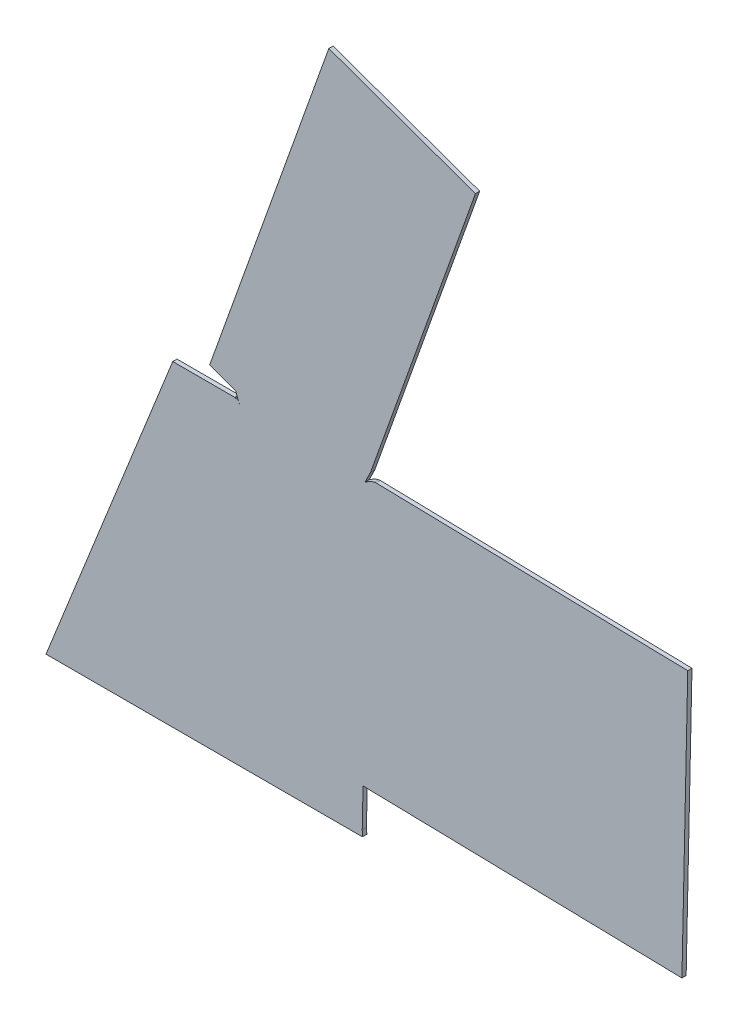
ISO-10303-21;
HEADER;
FILE_DESCRIPTION(('STEP AP214'),'2;1');
FILE_NAME('part.step','',(''),(''),'','','');
FILE_SCHEMA(('AUTOMOTIVE_DESIGN { 1 0 10303 214 1 1 1 1 }'));
ENDSEC;
DATA;
#1=APPLICATION_CONTEXT('core data for automotive mechanical design processes');
#2=APPLICATION_PROTOCOL_DEFINITION('international standard','automotive_design',2000,#1);
#3=PRODUCT_CONTEXT('',#1,'mechanical');
#4=PRODUCT('Part','Part','',(#3));
#5=PRODUCT_RELATED_PRODUCT_CATEGORY('part','',(#4));
#6=PRODUCT_DEFINITION_FORMATION('','',#4);
#7=PRODUCT_DEFINITION_CONTEXT('part definition',#1,'design');
#8=PRODUCT_DEFINITION('design','',#6,#7);
#9=PRODUCT_DEFINITION_SHAPE('','',#8);
#10=(LENGTH_UNIT() NAMED_UNIT(*) SI_UNIT(.MILLI.,.METRE.));
#11=(NAMED_UNIT(*) PLANE_ANGLE_UNIT() SI_UNIT($,.RADIAN.));
#12=(NAMED_UNIT(*) SI_UNIT($,.STERADIAN.) SOLID_ANGLE_UNIT());
#13=UNCERTAINTY_MEASURE_WITH_UNIT(LENGTH_MEASURE(1.E-05),#10,'distance_accuracy_value','');
#14=(GEOMETRIC_REPRESENTATION_CONTEXT(3) GLOBAL_UNCERTAINTY_ASSIGNED_CONTEXT((#13)) GLOBAL_UNIT_ASSIGNED_CONTEXT((#10,
#11,#12)) REPRESENTATION_CONTEXT('',''));
#15=CARTESIAN_POINT('',(0.,0.,0.));
#16=DIRECTION('',(0.,0.,1.));
#17=DIRECTION('',(1.,0.,0.));
#18=AXIS2_PLACEMENT_3D('',#15,#16,#17);
#19=CARTESIAN_POINT('',(73.2991904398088,21.0722076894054,-2.00000000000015));
#20=DIRECTION('',(0.0216745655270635,0.999765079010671,0.));
#21=DIRECTION('',(-0.315772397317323,0.00684583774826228,0.948810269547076));
#22=AXIS2_PLACEMENT_3D('',#19,#20,#21);
#23=PLANE('',#22);
#24=DIRECTION('',(0.,0.,1.));
#25=VECTOR('',#24,1.);
#26=CARTESIAN_POINT('',(75.1014282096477,21.0331357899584,-2.0000000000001));
#27=LINE('',#26,#25);
#28=CARTESIAN_POINT('',(75.1014282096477,21.0331357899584,-2.0000000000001));
#29=VERTEX_POINT('',#28);
#30=CARTESIAN_POINT('',(75.1014282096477,21.0331357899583,0.));
#31=VERTEX_POINT('',#30);
#32=EDGE_CURVE('E403',#29,#31,#27,.T.);
#33=ORIENTED_EDGE('',*,*,#32,.F.);
#34=DIRECTION('',(-0.999765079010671,0.0216745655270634,0.));
#35=VECTOR('',#34,1.);
#36=CARTESIAN_POINT('',(75.1014282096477,21.0331357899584,-2.0000000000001));
#37=LINE('',#36,#35);
#38=CARTESIAN_POINT('',(73.2991904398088,21.0722076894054,-2.0000000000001));
#39=VERTEX_POINT('',#38);
#40=EDGE_CURVE('E459',#29,#39,#37,.T.);
#41=ORIENTED_EDGE('',*,*,#40,.T.);
#42=DIRECTION('',(0.,0.,1.));
#43=VECTOR('',#42,1.);
#44=CARTESIAN_POINT('',(73.2991904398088,21.0722076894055,-2.0000000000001));
#45=LINE('',#44,#43);
#46=CARTESIAN_POINT('',(73.2991904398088,21.0722076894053,0.));
#47=VERTEX_POINT('',#46);
#48=EDGE_CURVE('E462',#39,#47,#45,.T.);
#49=ORIENTED_EDGE('',*,*,#48,.T.);
#50=DIRECTION('',(0.999765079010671,-0.0216745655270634,0.));
#51=VECTOR('',#50,1.);
#52=CARTESIAN_POINT('',(75.7670457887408,21.0187054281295,-1.04517089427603E-13));
#53=LINE('',#52,#51);
#54=EDGE_CURVE('E450',#47,#31,#53,.T.);
#55=ORIENTED_EDGE('',*,*,#54,.T.);
#56=EDGE_LOOP('',(#33,#41,#49,#55));
#57=FACE_BOUND('',#56,.T.);
#58=ADVANCED_FACE('F123',(#57),#23,.T.);
#59=CARTESIAN_POINT('',(75.3140911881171,0.125636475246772,-1.42247325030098E-13));
#60=DIRECTION('',(0.,0.,-1.));
#61=DIRECTION('',(-0.999785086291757,-0.0207311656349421,0.));
#62=AXIS2_PLACEMENT_3D('',#59,#60,#61);
#63=PLANE('',#62);
#64=ORIENTED_EDGE('',*,*,#54,.F.);
#65=DIRECTION('',(-0.99976507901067,0.0216745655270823,0.));
#66=VECTOR('',#65,1.);
#67=CARTESIAN_POINT('',(77.6712294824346,20.9774233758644,0.));
#68=LINE('',#67,#66);
#69=CARTESIAN_POINT('',(226.070760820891,17.7601722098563,1.74122868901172E-12));
#70=VERTEX_POINT('',#69);
#71=EDGE_CURVE('E405',#70,#47,#68,.T.);
#72=ORIENTED_EDGE('',*,*,#71,.F.);
#73=DIRECTION('',(0.0216745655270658,0.999765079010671,0.));
#74=VECTOR('',#73,1.);
#75=CARTESIAN_POINT('',(228.780081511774,142.73080708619,2.1163626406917E-12));
#76=LINE('',#75,#74);
#77=CARTESIAN_POINT('',(228.832735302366,145.159525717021,2.1163626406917E-12));
#78=VERTEX_POINT('',#77);
#79=EDGE_CURVE('E467',#70,#78,#76,.T.);
#80=ORIENTED_EDGE('',*,*,#79,.T.);
#81=DIRECTION('',(0.999765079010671,-0.0216745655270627,0.));
#82=VECTOR('',#81,1.);
#83=CARTESIAN_POINT('',(80.4332039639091,148.376776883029,3.15285991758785E-13));
#84=LINE('',#83,#82);
#85=CARTESIAN_POINT('',(81.2652259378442,148.358738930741,3.33066907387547E-13));
#86=VERTEX_POINT('',#85);
#87=EDGE_CURVE('E391',#86,#78,#84,.T.);
#88=ORIENTED_EDGE('',*,*,#87,.F.);
#89=CARTESIAN_POINT('',(80.4303448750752,148.244898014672,2.97938756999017E-13));
#90=CARTESIAN_POINT('',(80.4998448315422,148.263627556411,3.19189119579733E-13));
#91=CARTESIAN_POINT('',(80.6376474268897,148.300763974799,3.2612801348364E-13));
#92=CARTESIAN_POINT('',(80.8473160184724,148.336766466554,2.22044604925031E-13));
#93=CARTESIAN_POINT('',(81.0564439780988,148.358463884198,3.19189119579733E-13));
#94=CARTESIAN_POINT('',(81.1957784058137,148.358647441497,3.49980461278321E-13));
#95=CARTESIAN_POINT('',(81.2652259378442,148.358738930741,3.40005801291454E-13));
#96=B_SPLINE_CURVE_WITH_KNOTS('',3,(#89,#90,#91,#92,#93,#94,#95),.UNSPECIFIED.,.F.,.F.,(4,1,1,1,
4),(0.,0.255209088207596,0.506021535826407,0.753789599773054,1.),.UNSPECIFIED.);
#97=CARTESIAN_POINT('',(80.4303448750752,148.244898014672,2.97938756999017E-13));
#98=VERTEX_POINT('',#97);
#99=EDGE_CURVE('E370',#98,#86,#96,.T.);
#100=ORIENTED_EDGE('',*,*,#99,.F.);
#101=CARTESIAN_POINT('',(76.008511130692,146.042842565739,2.48327853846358E-13));
#102=CARTESIAN_POINT('',(77.4232207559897,147.002562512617,2.58530585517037E-13));
#103=CARTESIAN_POINT('',(78.1086837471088,147.373267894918,2.63228133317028E-13));
#104=CARTESIAN_POINT('',(79.1523921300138,147.937716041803,2.70380773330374E-13));
#105=CARTESIAN_POINT('',(80.4303448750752,148.244898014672,2.78137405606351E-13));
#106=B_SPLINE_CURVE_WITH_KNOTS('',2,(#101,#102,#103,#104,#105),.UNSPECIFIED.,.F.,.F.,(3,2,3),
(0.,0.5,1.),.UNSPECIFIED.);
#107=CARTESIAN_POINT('',(76.008511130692,146.042842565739,2.53269627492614E-13));
#108=VERTEX_POINT('',#107);
#109=EDGE_CURVE('E407',#108,#98,#106,.T.);
#110=ORIENTED_EDGE('',*,*,#109,.F.);
#111=DIRECTION('',(-0.441719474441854,-0.89715322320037,0.));
#112=VECTOR('',#111,1.);
#113=CARTESIAN_POINT('',(78.6874249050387,151.483843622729,3.05311331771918E-13));
#114=LINE('',#113,#112);
#115=CARTESIAN_POINT('',(78.6874249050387,151.483843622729,4.37150315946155E-13));
#116=VERTEX_POINT('',#115);
#117=EDGE_CURVE('E474',#116,#108,#114,.T.);
#118=ORIENTED_EDGE('',*,*,#117,.F.);
#119=DIRECTION('',(0.336313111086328,0.941750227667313,0.));
#120=VECTOR('',#119,1.);
#121=CARTESIAN_POINT('',(17.0300081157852,-21.1704014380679,-2.12330153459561E-12));
#122=LINE('',#121,#120);
#123=CARTESIAN_POINT('',(128.335891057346,290.510401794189,2.26901830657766E-12));
#124=VERTEX_POINT('',#123);
#125=EDGE_CURVE('E332',#116,#124,#122,.T.);
#126=ORIENTED_EDGE('',*,*,#125,.T.);
#127=DIRECTION('',(-0.941741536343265,0.336337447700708,0.));
#128=VECTOR('',#127,1.);
#129=CARTESIAN_POINT('',(73.0232796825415,310.264975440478,1.89431803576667E-12));
#130=LINE('',#129,#128);
#131=CARTESIAN_POINT('',(58.8971566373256,315.310037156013,1.81105130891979E-12));
#132=VERTEX_POINT('',#131);
#133=EDGE_CURVE('E330',#124,#132,#130,.T.);
#134=ORIENTED_EDGE('',*,*,#133,.T.);
#135=DIRECTION('',(-0.336337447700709,-0.941741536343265,0.));
#136=VECTOR('',#135,1.);
#137=CARTESIAN_POINT('',(2.45509657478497,157.272825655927,-2.25514051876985E-13));
#138=LINE('',#137,#136);
#139=CARTESIAN_POINT('',(2.45509657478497,157.272825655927,-2.25514051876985E-13));
#140=VERTEX_POINT('',#139);
#141=EDGE_CURVE('E328',#132,#140,#138,.T.);
#142=ORIENTED_EDGE('',*,*,#141,.T.);
#143=DIRECTION('',(0.941741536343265,-0.336337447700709,0.));
#144=VECTOR('',#143,1.);
#145=CARTESIAN_POINT('',(2.45509657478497,157.272825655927,-2.25514051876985E-13));
#146=LINE('',#145,#144);
#147=CARTESIAN_POINT('',(14.7851396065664,152.869223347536,-1.35308431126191E-13));
#148=VERTEX_POINT('',#147);
#149=EDGE_CURVE('E325',#140,#148,#146,.T.);
#150=ORIENTED_EDGE('',*,*,#149,.T.);
#151=DIRECTION('',(-0.357346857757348,0.933971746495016,0.));
#152=VECTOR('',#151,1.);
#153=CARTESIAN_POINT('',(16.9067401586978,147.324148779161,0.));
#154=LINE('',#153,#152);
#155=CARTESIAN_POINT('',(16.9067401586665,147.324148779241,0.));
#156=VERTEX_POINT('',#155);
#157=EDGE_CURVE('E327',#156,#148,#154,.T.);
#158=ORIENTED_EDGE('',*,*,#157,.F.);
#159=DIRECTION('',(0.371390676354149,-0.928476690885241,0.));
#160=VECTOR('',#159,1.);
#161=CARTESIAN_POINT('',(75.7210341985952,0.288413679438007,-1.2490009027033E-13));
#162=LINE('',#161,#160);
#163=CARTESIAN_POINT('',(15.8977554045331,149.846610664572,0.));
#164=VERTEX_POINT('',#163);
#165=EDGE_CURVE('E483',#164,#156,#162,.T.);
#166=ORIENTED_EDGE('',*,*,#165,.F.);
#167=DIRECTION('',(0.995853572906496,0.0909706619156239,0.));
#168=VECTOR('',#167,1.);
#169=CARTESIAN_POINT('',(14.635427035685,149.731297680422,0.));
#170=LINE('',#169,#168);
#171=CARTESIAN_POINT('',(14.635427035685,149.731297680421,0.));
#172=VERTEX_POINT('',#171);
#173=EDGE_CURVE('E316',#172,#164,#170,.T.);
#174=ORIENTED_EDGE('',*,*,#173,.F.);
#175=DIRECTION('',(1.,0.,0.));
#176=VECTOR('',#175,1.);
#177=CARTESIAN_POINT('',(-75.,149.731297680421,0.));
#178=LINE('',#177,#176);
#179=CARTESIAN_POINT('',(14.4086810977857,149.731297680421,0.));
#180=VERTEX_POINT('',#179);
#181=EDGE_CURVE('E287',#180,#172,#178,.T.);
#182=ORIENTED_EDGE('',*,*,#181,.F.);
#183=DIRECTION('',(-0.044282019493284,-0.999019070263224,0.));
#184=VECTOR('',#183,1.);
#185=CARTESIAN_POINT('',(7.60945957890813,-3.66170557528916,0.));
#186=LINE('',#185,#184);
#187=CARTESIAN_POINT('',(14.42059146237,150.,0.));
#188=VERTEX_POINT('',#187);
#189=EDGE_CURVE('E286',#188,#180,#186,.T.);
#190=ORIENTED_EDGE('',*,*,#189,.F.);
#191=DIRECTION('',(-1.,0.,0.));
#192=VECTOR('',#191,1.);
#193=CARTESIAN_POINT('',(15.,150.,0.));
#194=LINE('',#193,#192);
#195=CARTESIAN_POINT('',(-15.,150.,0.));
#196=VERTEX_POINT('',#195);
#197=EDGE_CURVE('E533',#188,#196,#194,.T.);
#198=ORIENTED_EDGE('',*,*,#197,.T.);
#199=DIRECTION('',(-0.371390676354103,-0.92847669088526,0.));
#200=VECTOR('',#199,1.);
#201=CARTESIAN_POINT('',(-15.,150.,0.));
#202=LINE('',#201,#200);
#203=CARTESIAN_POINT('',(-74.9999999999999,-1.94289029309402E-13,0.));
#204=VERTEX_POINT('',#203);
#205=EDGE_CURVE('E534',#196,#204,#202,.T.);
#206=ORIENTED_EDGE('',*,*,#205,.T.);
#207=DIRECTION('',(1.,0.,0.));
#208=VECTOR('',#207,1.);
#209=CARTESIAN_POINT('',(-74.9999999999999,-1.94289029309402E-13,0.));
#210=LINE('',#209,#208);
#211=CARTESIAN_POINT('',(74.5279461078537,0.,-1.38777878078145E-13));
#212=VERTEX_POINT('',#211);
#213=EDGE_CURVE('E288',#204,#212,#210,.T.);
#214=ORIENTED_EDGE('',*,*,#213,.T.);
#215=DIRECTION('',(-0.972003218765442,-0.234967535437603,0.));
#216=VECTOR('',#215,1.);
#217=CARTESIAN_POINT('',(74.9003030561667,0.0900118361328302,0.));
#218=LINE('',#217,#216);
#219=CARTESIAN_POINT('',(74.9003030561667,0.0900118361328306,0.));
#220=VERTEX_POINT('',#219);
#221=EDGE_CURVE('E315',#220,#212,#218,.T.);
#222=ORIENTED_EDGE('',*,*,#221,.F.);
#223=CARTESIAN_POINT('',(74.7066675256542,2.82433036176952,-1.38542843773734E-13));
#224=CARTESIAN_POINT('',(74.7725291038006,1.75034186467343,-1.40984080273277E-13));
#225=CARTESIAN_POINT('',(74.9003030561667,0.0900118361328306,-1.44615396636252E-13));
#226=B_SPLINE_CURVE_WITH_KNOTS('',2,(#223,#224,#225),.UNSPECIFIED.,.F.,.F.,(3,3),(0.,1.),.UNSPECIFIED.);
#227=CARTESIAN_POINT('',(74.7066675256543,2.82433036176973,-1.38777878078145E-13));
#228=VERTEX_POINT('',#227);
#229=EDGE_CURVE('E319',#228,#220,#226,.T.);
#230=ORIENTED_EDGE('',*,*,#229,.F.);
#231=DIRECTION('',(0.0216745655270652,0.999765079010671,0.));
#232=VECTOR('',#231,1.);
#233=CARTESIAN_POINT('',(74.648473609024,0.140066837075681,-1.49186218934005E-13));
#234=LINE('',#233,#232);
#235=EDGE_CURVE('E453',#228,#31,#234,.T.);
#236=ORIENTED_EDGE('',*,*,#235,.T.);
#237=EDGE_LOOP('',(#64,#72,#80,#88,#100,#110,#118,#126,#134,#142,#150,#158,#166,#174,#182,#190,
#198,#206,#214,#222,#230,#236));
#238=FACE_BOUND('',#237,.T.);
#239=ADVANCED_FACE('F495',(#238),#63,.F.);
#240=CARTESIAN_POINT('',(-74.9999999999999,-1.94289029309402E-13,-1.99999999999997));
#241=DIRECTION('',(0.,0.,1.));
#242=DIRECTION('',(1.,0.,0.));
#243=AXIS2_PLACEMENT_3D('',#240,#241,#242);
#244=PLANE('',#243);
#245=DIRECTION('',(-0.441719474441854,-0.89715322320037,0.));
#246=VECTOR('',#245,1.);
#247=CARTESIAN_POINT('',(78.6874249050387,151.483843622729,-1.9999999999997));
#248=LINE('',#247,#246);
#249=CARTESIAN_POINT('',(78.6874249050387,151.483843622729,-1.99999999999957));
#250=VERTEX_POINT('',#249);
#251=CARTESIAN_POINT('',(76.008511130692,146.042842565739,-1.99999999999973));
#252=VERTEX_POINT('',#251);
#253=EDGE_CURVE('E470',#250,#252,#248,.T.);
#254=ORIENTED_EDGE('',*,*,#253,.T.);
#255=CARTESIAN_POINT('',(76.008511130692,146.042842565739,-1.99999999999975));
#256=CARTESIAN_POINT('',(77.4232207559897,147.002562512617,-1.99999999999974));
#257=CARTESIAN_POINT('',(78.1086837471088,147.373267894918,-1.99999999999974));
#258=CARTESIAN_POINT('',(79.1523921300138,147.937716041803,-1.99999999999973));
#259=CARTESIAN_POINT('',(80.4303448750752,148.244898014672,-1.99999999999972));
#260=B_SPLINE_CURVE_WITH_KNOTS('',2,(#255,#256,#257,#258,#259),.UNSPECIFIED.,.F.,.F.,(3,2,3),
(0.,0.5,1.),.UNSPECIFIED.);
#261=CARTESIAN_POINT('',(80.4303448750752,148.244898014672,-1.99999999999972));
#262=VERTEX_POINT('',#261);
#263=EDGE_CURVE('E404',#252,#262,#260,.T.);
#264=ORIENTED_EDGE('',*,*,#263,.T.);
#265=CARTESIAN_POINT('',(80.4303448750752,148.244898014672,-1.9999999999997));
#266=CARTESIAN_POINT('',(80.4998448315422,148.263627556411,-1.99999999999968));
#267=CARTESIAN_POINT('',(80.6376474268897,148.300763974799,-1.9999999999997));
#268=CARTESIAN_POINT('',(80.8473160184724,148.336766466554,-1.99999999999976));
#269=CARTESIAN_POINT('',(81.0564439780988,148.358463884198,-1.99999999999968));
#270=CARTESIAN_POINT('',(81.1957784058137,148.358647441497,-1.99999999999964));
#271=CARTESIAN_POINT('',(81.2652259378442,148.358738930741,-1.99999999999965));
#272=B_SPLINE_CURVE_WITH_KNOTS('',3,(#265,#266,#267,#268,#269,#270,#271),.UNSPECIFIED.,.F.,.F.,
(4,1,1,1,4),(0.,0.255209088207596,0.506021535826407,0.753789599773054,1.),.UNSPECIFIED.);
#273=CARTESIAN_POINT('',(81.2652259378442,148.358738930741,-1.99999999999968));
#274=VERTEX_POINT('',#273);
#275=EDGE_CURVE('E378',#262,#274,#272,.T.);
#276=ORIENTED_EDGE('',*,*,#275,.T.);
#277=DIRECTION('',(0.999765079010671,-0.0216745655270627,0.));
#278=VECTOR('',#277,1.);
#279=CARTESIAN_POINT('',(80.4332039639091,148.376776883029,-1.9999999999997));
#280=LINE('',#279,#278);
#281=CARTESIAN_POINT('',(228.832735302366,145.159525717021,-1.99999999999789));
#282=VERTEX_POINT('',#281);
#283=EDGE_CURVE('E374',#274,#282,#280,.T.);
#284=ORIENTED_EDGE('',*,*,#283,.T.);
#285=DIRECTION('',(0.0216745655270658,0.999765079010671,0.));
#286=VECTOR('',#285,1.);
#287=CARTESIAN_POINT('',(228.780081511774,142.73080708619,-1.99999999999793));
#288=LINE('',#287,#286);
#289=CARTESIAN_POINT('',(226.070760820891,17.7601722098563,-1.99999999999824));
#290=VERTEX_POINT('',#289);
#291=EDGE_CURVE('E397',#290,#282,#288,.T.);
#292=ORIENTED_EDGE('',*,*,#291,.F.);
#293=DIRECTION('',(-0.99976507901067,0.0216745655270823,0.));
#294=VECTOR('',#293,1.);
#295=CARTESIAN_POINT('',(77.6712294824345,20.9774233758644,-2.00000000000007));
#296=LINE('',#295,#294);
#297=EDGE_CURVE('E400',#290,#39,#296,.T.);
#298=ORIENTED_EDGE('',*,*,#297,.T.);
#299=ORIENTED_EDGE('',*,*,#40,.F.);
#300=DIRECTION('',(0.0216745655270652,0.999765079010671,0.));
#301=VECTOR('',#300,1.);
#302=CARTESIAN_POINT('',(74.648473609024,0.140066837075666,-2.00000000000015));
#303=LINE('',#302,#301);
#304=CARTESIAN_POINT('',(74.7066675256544,2.82433036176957,-2.0000000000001));
#305=VERTEX_POINT('',#304);
#306=EDGE_CURVE('E456',#305,#29,#303,.T.);
#307=ORIENTED_EDGE('',*,*,#306,.F.);
#308=CARTESIAN_POINT('',(74.7066675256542,2.82433036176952,-2.00000000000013));
#309=CARTESIAN_POINT('',(74.7725291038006,1.75034186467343,-2.00000000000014));
#310=CARTESIAN_POINT('',(74.9003030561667,0.0900118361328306,-2.00000000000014));
#311=B_SPLINE_CURVE_WITH_KNOTS('',2,(#308,#309,#310),.UNSPECIFIED.,.F.,.F.,(3,3),(0.,1.),.UNSPECIFIED.);
#312=CARTESIAN_POINT('',(74.9003030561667,0.0900118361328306,-2.00000000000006));
#313=VERTEX_POINT('',#312);
#314=EDGE_CURVE('E314',#305,#313,#311,.T.);
#315=ORIENTED_EDGE('',*,*,#314,.T.);
#316=DIRECTION('',(-0.972003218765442,-0.234967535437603,0.));
#317=VECTOR('',#316,1.);
#318=CARTESIAN_POINT('',(74.9003030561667,0.0900118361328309,-2.00000000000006));
#319=LINE('',#318,#317);
#320=CARTESIAN_POINT('',(74.5279461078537,0.,-2.00000000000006));
#321=VERTEX_POINT('',#320);
#322=EDGE_CURVE('E320',#313,#321,#319,.T.);
#323=ORIENTED_EDGE('',*,*,#322,.T.);
#324=DIRECTION('',(1.,0.,0.));
#325=VECTOR('',#324,1.);
#326=CARTESIAN_POINT('',(-74.9999999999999,-1.94289029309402E-13,-1.99999999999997));
#327=LINE('',#326,#325);
#328=CARTESIAN_POINT('',(-74.9999999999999,-1.94289029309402E-13,-1.99999999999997));
#329=VERTEX_POINT('',#328);
#330=EDGE_CURVE('E294',#329,#321,#327,.T.);
#331=ORIENTED_EDGE('',*,*,#330,.F.);
#332=DIRECTION('',(-0.371390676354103,-0.92847669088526,0.));
#333=VECTOR('',#332,1.);
#334=CARTESIAN_POINT('',(-15.,150.,-1.99999999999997));
#335=LINE('',#334,#333);
#336=CARTESIAN_POINT('',(-15.,150.,-1.99999999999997));
#337=VERTEX_POINT('',#336);
#338=EDGE_CURVE('E301',#337,#329,#335,.T.);
#339=ORIENTED_EDGE('',*,*,#338,.F.);
#340=DIRECTION('',(-1.,0.,0.));
#341=VECTOR('',#340,1.);
#342=CARTESIAN_POINT('',(15.,150.,-2.00000000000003));
#343=LINE('',#342,#341);
#344=CARTESIAN_POINT('',(14.42059146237,150.,-2.));
#345=VERTEX_POINT('',#344);
#346=EDGE_CURVE('E293',#345,#337,#343,.T.);
#347=ORIENTED_EDGE('',*,*,#346,.F.);
#348=DIRECTION('',(-0.044282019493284,-0.999019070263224,0.));
#349=VECTOR('',#348,1.);
#350=CARTESIAN_POINT('',(7.60945957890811,-3.66170557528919,-2.00000000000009));
#351=LINE('',#350,#349);
#352=CARTESIAN_POINT('',(14.4086810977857,149.731297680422,-2.00000000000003));
#353=VERTEX_POINT('',#352);
#354=EDGE_CURVE('E279',#345,#353,#351,.T.);
#355=ORIENTED_EDGE('',*,*,#354,.T.);
#356=DIRECTION('',(1.,0.,0.));
#357=VECTOR('',#356,1.);
#358=CARTESIAN_POINT('',(-75.,149.731297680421,-1.99999999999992));
#359=LINE('',#358,#357);
#360=CARTESIAN_POINT('',(14.635427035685,149.731297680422,-2.00000000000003));
#361=VERTEX_POINT('',#360);
#362=EDGE_CURVE('E268',#353,#361,#359,.T.);
#363=ORIENTED_EDGE('',*,*,#362,.T.);
#364=DIRECTION('',(0.995853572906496,0.0909706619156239,0.));
#365=VECTOR('',#364,1.);
#366=CARTESIAN_POINT('',(14.635427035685,149.731297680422,-1.99999999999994));
#367=LINE('',#366,#365);
#368=CARTESIAN_POINT('',(15.8977554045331,149.846610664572,-2.00000000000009));
#369=VERTEX_POINT('',#368);
#370=EDGE_CURVE('E312',#361,#369,#367,.T.);
#371=ORIENTED_EDGE('',*,*,#370,.T.);
#372=DIRECTION('',(0.371390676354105,-0.928476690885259,0.));
#373=VECTOR('',#372,1.);
#374=CARTESIAN_POINT('',(15.721034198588,150.288413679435,-2.00000000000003));
#375=LINE('',#374,#373);
#376=CARTESIAN_POINT('',(16.9067401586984,147.324148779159,-1.99999999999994));
#377=VERTEX_POINT('',#376);
#378=EDGE_CURVE('E13',#369,#377,#375,.T.);
#379=ORIENTED_EDGE('',*,*,#378,.T.);
#380=DIRECTION('',(-0.357346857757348,0.933971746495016,0.));
#381=VECTOR('',#380,1.);
#382=CARTESIAN_POINT('',(16.9067401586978,147.324148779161,-2.00000000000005));
#383=LINE('',#382,#381);
#384=CARTESIAN_POINT('',(14.7851396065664,152.869223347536,-2.00000000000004));
#385=VERTEX_POINT('',#384);
#386=EDGE_CURVE('E473',#377,#385,#383,.T.);
#387=ORIENTED_EDGE('',*,*,#386,.T.);
#388=DIRECTION('',(0.941741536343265,-0.336337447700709,0.));
#389=VECTOR('',#388,1.);
#390=CARTESIAN_POINT('',(2.45509657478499,157.272825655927,-2.00000000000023));
#391=LINE('',#390,#389);
#392=CARTESIAN_POINT('',(2.45509657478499,157.272825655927,-2.00000000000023));
#393=VERTEX_POINT('',#392);
#394=EDGE_CURVE('E335',#393,#385,#391,.T.);
#395=ORIENTED_EDGE('',*,*,#394,.F.);
#396=DIRECTION('',(-0.336337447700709,-0.941741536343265,0.));
#397=VECTOR('',#396,1.);
#398=CARTESIAN_POINT('',(2.45509657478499,157.272825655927,-2.00000000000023));
#399=LINE('',#398,#397);
#400=CARTESIAN_POINT('',(58.8971566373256,315.310037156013,-1.99999999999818));
#401=VERTEX_POINT('',#400);
#402=EDGE_CURVE('E351',#401,#393,#399,.T.);
#403=ORIENTED_EDGE('',*,*,#402,.F.);
#404=DIRECTION('',(-0.941741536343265,0.33633744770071,0.));
#405=VECTOR('',#404,1.);
#406=CARTESIAN_POINT('',(58.8971566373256,315.310037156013,-1.99999999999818));
#407=LINE('',#406,#405);
#408=CARTESIAN_POINT('',(128.335891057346,290.510401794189,-1.99999999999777));
#409=VERTEX_POINT('',#408);
#410=EDGE_CURVE('E343',#409,#401,#407,.T.);
#411=ORIENTED_EDGE('',*,*,#410,.F.);
#412=DIRECTION('',(-0.336313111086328,-0.941750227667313,0.));
#413=VECTOR('',#412,1.);
#414=CARTESIAN_POINT('',(71.8979143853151,132.47173000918,-1.99999999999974));
#415=LINE('',#414,#413);
#416=EDGE_CURVE('E341',#409,#250,#415,.T.);
#417=ORIENTED_EDGE('',*,*,#416,.T.);
#418=EDGE_LOOP('',(#254,#264,#276,#284,#292,#298,#299,#307,#315,#323,#331,#339,#347,#355,#363,
#371,#379,#387,#395,#403,#411,#417));
#419=FACE_BOUND('',#418,.T.);
#420=ADVANCED_FACE('F125',(#419),#244,.F.);
#421=CARTESIAN_POINT('',(74.648473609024,0.140066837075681,-1.49186218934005E-13));
#422=DIRECTION('',(-0.999765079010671,0.0216745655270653,0.));
#423=DIRECTION('',(0.0216745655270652,0.999765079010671,0.));
#424=AXIS2_PLACEMENT_3D('',#421,#422,#423);
#425=PLANE('',#424);
#426=ORIENTED_EDGE('',*,*,#306,.T.);
#427=ORIENTED_EDGE('',*,*,#32,.T.);
#428=ORIENTED_EDGE('',*,*,#235,.F.);
#429=DIRECTION('',(0.,0.,-1.));
#430=VECTOR('',#429,1.);
#431=CARTESIAN_POINT('',(74.7066675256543,2.82433036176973,-1.41957702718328E-13));
#432=LINE('',#431,#430);
#433=EDGE_CURVE('E488',#228,#305,#432,.T.);
#434=ORIENTED_EDGE('',*,*,#433,.T.);
#435=EDGE_LOOP('',(#426,#427,#428,#434));
#436=FACE_BOUND('',#435,.T.);
#437=ADVANCED_FACE('F506',(#436),#425,.F.);
#438=CARTESIAN_POINT('',(16.9067401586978,147.324148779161,-2.00000000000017));
#439=DIRECTION('',(0.928476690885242,0.371390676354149,0.));
#440=DIRECTION('',(-0.371390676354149,0.928476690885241,0.));
#441=AXIS2_PLACEMENT_3D('',#438,#439,#440);
#442=PLANE('',#441);
#443=DIRECTION('',(0.,0.,1.));
#444=VECTOR('',#443,1.);
#445=CARTESIAN_POINT('',(15.8977554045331,149.846610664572,-2.00000000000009));
#446=LINE('',#445,#444);
#447=EDGE_CURVE('E133',#369,#164,#446,.T.);
#448=ORIENTED_EDGE('',*,*,#447,.T.);
#449=ORIENTED_EDGE('',*,*,#165,.T.);
#450=DIRECTION('',(0.,0.,1.));
#451=VECTOR('',#450,1.);
#452=CARTESIAN_POINT('',(16.9067401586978,147.324148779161,-2.00000000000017));
#453=LINE('',#452,#451);
#454=EDGE_CURVE('E465',#156,#377,#453,.F.);
#455=ORIENTED_EDGE('',*,*,#454,.T.);
#456=ORIENTED_EDGE('',*,*,#378,.F.);
#457=EDGE_LOOP('',(#448,#449,#455,#456));
#458=FACE_BOUND('',#457,.T.);
#459=ADVANCED_FACE('F431',(#458),#442,.T.);
#460=CARTESIAN_POINT('',(76.008511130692,146.042842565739,-1.99999999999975));
#461=CARTESIAN_POINT('',(76.4800810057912,146.362749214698,-1.99999999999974));
#462=CARTESIAN_POINT('',(76.8908803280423,146.63357131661,-1.99999999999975));
#463=CARTESIAN_POINT('',(77.4159234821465,146.966177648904,-1.99999999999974));
#464=CARTESIAN_POINT('',(77.5757452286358,147.064775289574,-1.99999999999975));
#465=CARTESIAN_POINT('',(77.7926888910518,147.194265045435,-1.99999999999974));
#466=CARTESIAN_POINT('',(77.8612052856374,147.234360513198,-1.99999999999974));
#467=CARTESIAN_POINT('',(77.9582826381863,147.289902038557,-1.99999999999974));
#468=CARTESIAN_POINT('',(77.9896922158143,147.307648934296,-1.99999999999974));
#469=CARTESIAN_POINT('',(78.035382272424,147.333118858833,-1.99999999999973));
#470=CARTESIAN_POINT('',(78.0503749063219,147.341417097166,-1.99999999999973));
#471=CARTESIAN_POINT('',(78.0798854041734,147.35763010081,-1.99999999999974));
#472=CARTESIAN_POINT('',(78.086939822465,147.361508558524,-1.99999999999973));
#473=CARTESIAN_POINT('',(78.8044893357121,147.749566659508,-1.99999999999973));
#474=CARTESIAN_POINT('',(79.5783763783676,148.040110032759,-1.99999999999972));
#475=CARTESIAN_POINT('',(80.4303448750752,148.244898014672,-1.99999999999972));
#476=CARTESIAN_POINT('',(76.008511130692,146.042842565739,2.53269627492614E-13));
#477=CARTESIAN_POINT('',(76.4800810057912,146.362749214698,2.53269627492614E-13));
#478=CARTESIAN_POINT('',(76.8908803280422,146.63357131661,2.60208521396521E-13));
#479=CARTESIAN_POINT('',(77.4159234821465,146.966177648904,2.60208521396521E-13));
#480=CARTESIAN_POINT('',(77.5757452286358,147.064775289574,2.60208521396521E-13));
#481=CARTESIAN_POINT('',(77.7926888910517,147.194265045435,2.63677968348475E-13));
#482=CARTESIAN_POINT('',(77.8612052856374,147.234360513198,2.60208521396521E-13));
#483=CARTESIAN_POINT('',(77.9582826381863,147.289902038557,2.6324428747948E-13));
#484=CARTESIAN_POINT('',(77.9896922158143,147.307648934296,2.63677968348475E-13));
#485=CARTESIAN_POINT('',(78.035382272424,147.333118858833,2.70616862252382E-13));
#486=CARTESIAN_POINT('',(78.0503749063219,147.341417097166,2.74086309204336E-13));
#487=CARTESIAN_POINT('',(78.0798854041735,147.35763010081,2.70616862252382E-13));
#488=CARTESIAN_POINT('',(78.0869398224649,147.361508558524,2.74086309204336E-13));
#489=CARTESIAN_POINT('',(78.8044893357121,147.749566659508,2.70183181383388E-13));
#490=CARTESIAN_POINT('',(79.5783763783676,148.040110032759,2.84494650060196E-13));
#491=CARTESIAN_POINT('',(80.4303448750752,148.244898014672,2.84060969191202E-13));
#492=B_SPLINE_SURFACE_WITH_KNOTS('',1,3,((#460,#461,#462,#463,#464,#465,#466,#467,#468,#469,
#470,#471,#472,#473,#474,#475),(#476,#477,#478,#479,#480,#481,#482,#483,#484,#485,#486,#487,
#488,#489,#490,#491)),.UNSPECIFIED.,.F.,.F.,.F.,(2,2),(4,2,2,2,2,2,2,4),(0.,1.),(0.,0.25,0.375,
0.4375,0.46875,0.484375,0.5,1.),.UNSPECIFIED.);
#493=DIRECTION('',(0.,0.,-1.));
#494=VECTOR('',#493,1.);
#495=CARTESIAN_POINT('',(76.008511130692,146.042842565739,-0.99999999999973));
#496=LINE('',#495,#494);
#497=EDGE_CURVE('E484',#108,#252,#496,.T.);
#498=CARTESIAN_POINT('',(80.4303448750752,148.244898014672,2.84060969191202E-13));
#499=CARTESIAN_POINT('',(80.4303448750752,148.244898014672,-1.99999999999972));
#500=B_SPLINE_CURVE_WITH_KNOTS('',1,(#498,#499),.UNSPECIFIED.,.F.,.F.,(2,2),(0.,1.),.UNSPECIFIED.);
#501=EDGE_CURVE('E399',#98,#262,#500,.T.);
#502=ORIENTED_EDGE('',*,*,#497,.F.);
#503=ORIENTED_EDGE('',*,*,#109,.T.);
#504=ORIENTED_EDGE('',*,*,#501,.T.);
#505=ORIENTED_EDGE('',*,*,#263,.F.);
#506=EDGE_LOOP('',(#502,#503,#504,#505));
#507=FACE_BOUND('',#506,.T.);
#508=ADVANCED_FACE('F424',(#507),#492,.T.);
#509=CARTESIAN_POINT('',(77.6712294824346,20.9774233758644,-1.00000000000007));
#510=DIRECTION('',(-0.0216745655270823,-0.99976507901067,0.));
#511=DIRECTION('',(-0.99976507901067,0.0216745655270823,0.));
#512=AXIS2_PLACEMENT_3D('',#509,#510,#511);
#513=PLANE('',#512);
#514=ORIENTED_EDGE('',*,*,#71,.T.);
#515=ORIENTED_EDGE('',*,*,#48,.F.);
#516=ORIENTED_EDGE('',*,*,#297,.F.);
#517=DIRECTION('',(0.,0.,-1.));
#518=VECTOR('',#517,1.);
#519=CARTESIAN_POINT('',(226.070760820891,17.7601722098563,1.74122868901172E-12));
#520=LINE('',#519,#518);
#521=EDGE_CURVE('E394',#70,#290,#520,.T.);
#522=ORIENTED_EDGE('',*,*,#521,.F.);
#523=EDGE_LOOP('',(#514,#515,#516,#522));
#524=FACE_BOUND('',#523,.T.);
#525=ADVANCED_FACE('F430',(#524),#513,.T.);
#526=CARTESIAN_POINT('',(228.780081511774,142.73080708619,2.1163626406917E-12));
#527=DIRECTION('',(-0.999765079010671,0.0216745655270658,0.));
#528=DIRECTION('',(-0.0216745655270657,-0.999765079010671,0.));
#529=AXIS2_PLACEMENT_3D('',#526,#527,#528);
#530=PLANE('',#529);
#531=ORIENTED_EDGE('',*,*,#291,.T.);
#532=DIRECTION('',(0.,0.,-1.));
#533=VECTOR('',#532,1.);
#534=CARTESIAN_POINT('',(228.832735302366,145.159525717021,2.1163626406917E-12));
#535=LINE('',#534,#533);
#536=EDGE_CURVE('E381',#78,#282,#535,.T.);
#537=ORIENTED_EDGE('',*,*,#536,.F.);
#538=ORIENTED_EDGE('',*,*,#79,.F.);
#539=ORIENTED_EDGE('',*,*,#521,.T.);
#540=EDGE_LOOP('',(#531,#537,#538,#539));
#541=FACE_BOUND('',#540,.T.);
#542=ADVANCED_FACE('F584',(#541),#530,.F.);
#543=CARTESIAN_POINT('',(80.4332039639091,148.376776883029,3.15285991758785E-13));
#544=DIRECTION('',(0.0216745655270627,0.999765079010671,0.));
#545=DIRECTION('',(-0.998866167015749,0.0216550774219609,-0.0423962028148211));
#546=AXIS2_PLACEMENT_3D('',#543,#544,#545);
#547=PLANE('',#546);
#548=ORIENTED_EDGE('',*,*,#283,.F.);
#549=DIRECTION('',(0.,0.,-1.));
#550=VECTOR('',#549,1.);
#551=CARTESIAN_POINT('',(81.2652259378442,148.358738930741,3.33066907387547E-13));
#552=LINE('',#551,#550);
#553=EDGE_CURVE('E373',#86,#274,#552,.T.);
#554=ORIENTED_EDGE('',*,*,#553,.F.);
#555=ORIENTED_EDGE('',*,*,#87,.T.);
#556=ORIENTED_EDGE('',*,*,#536,.T.);
#557=EDGE_LOOP('',(#548,#554,#555,#556));
#558=FACE_BOUND('',#557,.T.);
#559=ADVANCED_FACE('F580',(#558),#547,.T.);
#560=DIRECTION('',(0.,0.,-1.));
#561=VECTOR('',#560,1.);
#562=SURFACE_OF_LINEAR_EXTRUSION('',#96,#561);
#563=ORIENTED_EDGE('',*,*,#275,.F.);
#564=ORIENTED_EDGE('',*,*,#501,.F.);
#565=ORIENTED_EDGE('',*,*,#99,.T.);
#566=ORIENTED_EDGE('',*,*,#553,.T.);
#567=EDGE_LOOP('',(#563,#564,#565,#566));
#568=FACE_BOUND('',#567,.T.);
#569=ADVANCED_FACE('F365',(#568),#562,.T.);
#570=CARTESIAN_POINT('',(16.9067401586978,147.324148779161,-1.00000000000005));
#571=DIRECTION('',(-0.933971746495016,-0.357346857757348,0.));
#572=DIRECTION('',(-0.357346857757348,0.933971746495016,0.));
#573=AXIS2_PLACEMENT_3D('',#570,#571,#572);
#574=PLANE('',#573);
#575=ORIENTED_EDGE('',*,*,#454,.F.);
#576=ORIENTED_EDGE('',*,*,#157,.T.);
#577=DIRECTION('',(0.,0.,-1.));
#578=VECTOR('',#577,1.);
#579=CARTESIAN_POINT('',(14.7851396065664,152.869223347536,-1.00000000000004));
#580=LINE('',#579,#578);
#581=EDGE_CURVE('E340',#148,#385,#580,.T.);
#582=ORIENTED_EDGE('',*,*,#581,.T.);
#583=ORIENTED_EDGE('',*,*,#386,.F.);
#584=EDGE_LOOP('',(#575,#576,#582,#583));
#585=FACE_BOUND('',#584,.T.);
#586=ADVANCED_FACE('F550',(#585),#574,.T.);
#587=CARTESIAN_POINT('',(78.6874249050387,151.483843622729,-0.999999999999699));
#588=DIRECTION('',(0.89715322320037,-0.441719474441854,0.));
#589=DIRECTION('',(-0.441719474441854,-0.89715322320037,0.));
#590=AXIS2_PLACEMENT_3D('',#587,#588,#589);
#591=PLANE('',#590);
#592=ORIENTED_EDGE('',*,*,#117,.T.);
#593=ORIENTED_EDGE('',*,*,#497,.T.);
#594=ORIENTED_EDGE('',*,*,#253,.F.);
#595=DIRECTION('',(0.,0.,-1.));
#596=VECTOR('',#595,1.);
#597=CARTESIAN_POINT('',(78.6874249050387,151.483843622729,2.81025203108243E-13));
#598=LINE('',#597,#596);
#599=EDGE_CURVE('E353',#116,#250,#598,.T.);
#600=ORIENTED_EDGE('',*,*,#599,.F.);
#601=EDGE_LOOP('',(#592,#593,#594,#600));
#602=FACE_BOUND('',#601,.T.);
#603=ADVANCED_FACE('F564',(#602),#591,.T.);
#604=CARTESIAN_POINT('',(2.45509657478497,157.272825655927,-2.25514051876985E-13));
#605=DIRECTION('',(0.941741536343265,-0.336337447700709,0.));
#606=DIRECTION('',(0.333342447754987,0.933355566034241,0.133154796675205));
#607=AXIS2_PLACEMENT_3D('',#604,#605,#606);
#608=PLANE('',#607);
#609=ORIENTED_EDGE('',*,*,#402,.T.);
#610=DIRECTION('',(0.,0.,-1.));
#611=VECTOR('',#610,1.);
#612=CARTESIAN_POINT('',(2.45509657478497,157.272825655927,-2.25514051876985E-13));
#613=LINE('',#612,#611);
#614=EDGE_CURVE('E337',#140,#393,#613,.T.);
#615=ORIENTED_EDGE('',*,*,#614,.F.);
#616=ORIENTED_EDGE('',*,*,#141,.F.);
#617=DIRECTION('',(0.,0.,-1.));
#618=VECTOR('',#617,1.);
#619=CARTESIAN_POINT('',(58.8971566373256,315.310037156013,1.81105130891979E-12));
#620=LINE('',#619,#618);
#621=EDGE_CURVE('E348',#132,#401,#620,.T.);
#622=ORIENTED_EDGE('',*,*,#621,.T.);
#623=EDGE_LOOP('',(#609,#615,#616,#622));
#624=FACE_BOUND('',#623,.T.);
#625=ADVANCED_FACE('F573',(#624),#608,.F.);
#626=CARTESIAN_POINT('',(58.8971566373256,315.310037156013,1.81105130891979E-12));
#627=DIRECTION('',(-0.33633744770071,-0.941741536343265,0.));
#628=DIRECTION('',(0.,0.,-1.));
#629=AXIS2_PLACEMENT_3D('',#626,#627,#628);
#630=PLANE('',#629);
#631=ORIENTED_EDGE('',*,*,#133,.F.);
#632=DIRECTION('',(0.,0.,-1.));
#633=VECTOR('',#632,1.);
#634=CARTESIAN_POINT('',(128.335891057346,290.510401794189,2.31759056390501E-12));
#635=LINE('',#634,#633);
#636=EDGE_CURVE('E345',#124,#409,#635,.T.);
#637=ORIENTED_EDGE('',*,*,#636,.T.);
#638=ORIENTED_EDGE('',*,*,#410,.T.);
#639=ORIENTED_EDGE('',*,*,#621,.F.);
#640=EDGE_LOOP('',(#631,#637,#638,#639));
#641=FACE_BOUND('',#640,.T.);
#642=ADVANCED_FACE('F570',(#641),#630,.F.);
#643=CARTESIAN_POINT('',(2.45509657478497,157.272825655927,-2.25514051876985E-13));
#644=DIRECTION('',(0.336337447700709,0.941741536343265,0.));
#645=DIRECTION('',(0.,0.,1.));
#646=AXIS2_PLACEMENT_3D('',#643,#644,#645);
#647=PLANE('',#646);
#648=ORIENTED_EDGE('',*,*,#581,.F.);
#649=ORIENTED_EDGE('',*,*,#149,.F.);
#650=ORIENTED_EDGE('',*,*,#614,.T.);
#651=ORIENTED_EDGE('',*,*,#394,.T.);
#652=EDGE_LOOP('',(#648,#649,#650,#651));
#653=FACE_BOUND('',#652,.T.);
#654=ADVANCED_FACE('F625',(#653),#647,.F.);
#655=CARTESIAN_POINT('',(17.0300081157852,-21.1704014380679,-2.12330153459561E-12));
#656=DIRECTION('',(-0.941750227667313,0.336313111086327,0.));
#657=DIRECTION('',(-0.333318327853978,-0.933364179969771,-0.133154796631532));
#658=AXIS2_PLACEMENT_3D('',#655,#656,#657);
#659=PLANE('',#658);
#660=ORIENTED_EDGE('',*,*,#416,.F.);
#661=ORIENTED_EDGE('',*,*,#636,.F.);
#662=ORIENTED_EDGE('',*,*,#125,.F.);
#663=ORIENTED_EDGE('',*,*,#599,.T.);
#664=EDGE_LOOP('',(#660,#661,#662,#663));
#665=FACE_BOUND('',#664,.T.);
#666=ADVANCED_FACE('F560',(#665),#659,.F.);
#667=CARTESIAN_POINT('',(14.635427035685,149.731297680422,-0.999999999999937));
#668=DIRECTION('',(-0.0909706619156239,0.995853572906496,0.));
#669=DIRECTION('',(0.995853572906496,0.0909706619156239,0.));
#670=AXIS2_PLACEMENT_3D('',#667,#668,#669);
#671=PLANE('',#670);
#672=DIRECTION('',(0.,0.,1.));
#673=VECTOR('',#672,1.);
#674=CARTESIAN_POINT('',(14.635427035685,149.731297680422,-2.00000000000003));
#675=LINE('',#674,#673);
#676=EDGE_CURVE('E274',#361,#172,#675,.T.);
#677=ORIENTED_EDGE('',*,*,#676,.T.);
#678=ORIENTED_EDGE('',*,*,#173,.T.);
#679=ORIENTED_EDGE('',*,*,#447,.F.);
#680=ORIENTED_EDGE('',*,*,#370,.F.);
#681=EDGE_LOOP('',(#677,#678,#679,#680));
#682=FACE_BOUND('',#681,.T.);
#683=ADVANCED_FACE('F542',(#682),#671,.T.);
#684=CARTESIAN_POINT('',(74.7066675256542,2.82433036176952,-2.00000000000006));
#685=CARTESIAN_POINT('',(74.7505752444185,2.10833803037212,-2.00000000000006));
#686=CARTESIAN_POINT('',(74.815120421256,1.19689852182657,-2.00000000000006));
#687=CARTESIAN_POINT('',(74.9003030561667,0.0900118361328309,-2.00000000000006));
#688=CARTESIAN_POINT('',(74.7066675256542,2.82433036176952,0.));
#689=CARTESIAN_POINT('',(74.7505752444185,2.10833803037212,0.));
#690=CARTESIAN_POINT('',(74.815120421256,1.19689852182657,0.));
#691=CARTESIAN_POINT('',(74.9003030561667,0.0900118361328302,0.));
#692=B_SPLINE_SURFACE_WITH_KNOTS('',1,3,((#684,#685,#686,#687),(#688,#689,#690,#691)),
.UNSPECIFIED.,.F.,.F.,.F.,(2,2),(4,4),(0.,1.),(0.,1.),.UNSPECIFIED.);
#693=DIRECTION('',(0.,0.,-1.));
#694=VECTOR('',#693,1.);
#695=CARTESIAN_POINT('',(74.9003030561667,0.0900118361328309,-1.00000000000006));
#696=LINE('',#695,#694);
#697=EDGE_CURVE('E127',#220,#313,#696,.T.);
#698=ORIENTED_EDGE('',*,*,#433,.F.);
#699=ORIENTED_EDGE('',*,*,#229,.T.);
#700=ORIENTED_EDGE('',*,*,#697,.T.);
#701=ORIENTED_EDGE('',*,*,#314,.F.);
#702=EDGE_LOOP('',(#698,#699,#700,#701));
#703=FACE_BOUND('',#702,.T.);
#704=ADVANCED_FACE('F523',(#703),#692,.T.);
#705=CARTESIAN_POINT('',(74.9003030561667,0.0900118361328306,-1.00000000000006));
#706=DIRECTION('',(0.234967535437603,-0.972003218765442,0.));
#707=DIRECTION('',(-0.972003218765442,-0.234967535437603,0.));
#708=AXIS2_PLACEMENT_3D('',#705,#706,#707);
#709=PLANE('',#708);
#710=ORIENTED_EDGE('',*,*,#221,.T.);
#711=DIRECTION('',(0.,0.,1.));
#712=VECTOR('',#711,1.);
#713=CARTESIAN_POINT('',(74.5279461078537,0.,-1.99999999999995));
#714=LINE('',#713,#712);
#715=EDGE_CURVE('E296',#321,#212,#714,.T.);
#716=ORIENTED_EDGE('',*,*,#715,.F.);
#717=ORIENTED_EDGE('',*,*,#322,.F.);
#718=ORIENTED_EDGE('',*,*,#697,.F.);
#719=EDGE_LOOP('',(#710,#716,#717,#718));
#720=FACE_BOUND('',#719,.T.);
#721=ADVANCED_FACE('F528',(#720),#709,.T.);
#722=CARTESIAN_POINT('',(7.60945957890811,-3.66170557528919,-2.00000000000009));
#723=DIRECTION('',(-0.999019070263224,0.0442820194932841,0.));
#724=DIRECTION('',(-0.044282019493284,-0.999019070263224,0.));
#725=AXIS2_PLACEMENT_3D('',#722,#723,#724);
#726=PLANE('',#725);
#727=ORIENTED_EDGE('',*,*,#354,.F.);
#728=DIRECTION('',(0.,0.,-1.));
#729=VECTOR('',#728,1.);
#730=CARTESIAN_POINT('',(14.42059146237,150.,-2.));
#731=LINE('',#730,#729);
#732=EDGE_CURVE('E309',#345,#188,#731,.F.);
#733=ORIENTED_EDGE('',*,*,#732,.T.);
#734=ORIENTED_EDGE('',*,*,#189,.T.);
#735=DIRECTION('',(0.,0.,-1.));
#736=VECTOR('',#735,1.);
#737=CARTESIAN_POINT('',(14.4086810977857,149.731297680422,-2.00000000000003));
#738=LINE('',#737,#736);
#739=EDGE_CURVE('E271',#353,#180,#738,.F.);
#740=ORIENTED_EDGE('',*,*,#739,.F.);
#741=EDGE_LOOP('',(#727,#733,#734,#740));
#742=FACE_BOUND('',#741,.T.);
#743=ADVANCED_FACE('F283',(#742),#726,.F.);
#744=CARTESIAN_POINT('',(15.,150.,-2.00000000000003));
#745=DIRECTION('',(0.,1.,0.));
#746=DIRECTION('',(0.,0.,1.));
#747=AXIS2_PLACEMENT_3D('',#744,#745,#746);
#748=PLANE('',#747);
#749=ORIENTED_EDGE('',*,*,#197,.F.);
#750=ORIENTED_EDGE('',*,*,#732,.F.);
#751=ORIENTED_EDGE('',*,*,#346,.T.);
#752=DIRECTION('',(0.,0.,1.));
#753=VECTOR('',#752,1.);
#754=CARTESIAN_POINT('',(-15.,150.,-1.99999999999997));
#755=LINE('',#754,#753);
#756=EDGE_CURVE('E304',#337,#196,#755,.T.);
#757=ORIENTED_EDGE('',*,*,#756,.T.);
#758=EDGE_LOOP('',(#749,#750,#751,#757));
#759=FACE_BOUND('',#758,.T.);
#760=ADVANCED_FACE('F594',(#759),#748,.T.);
#761=CARTESIAN_POINT('',(-15.,150.,-1.99999999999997));
#762=DIRECTION('',(-0.92847669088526,0.371390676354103,0.));
#763=DIRECTION('',(-0.371390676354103,-0.92847669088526,0.));
#764=AXIS2_PLACEMENT_3D('',#761,#762,#763);
#765=PLANE('',#764);
#766=ORIENTED_EDGE('',*,*,#205,.F.);
#767=ORIENTED_EDGE('',*,*,#756,.F.);
#768=ORIENTED_EDGE('',*,*,#338,.T.);
#769=DIRECTION('',(0.,0.,1.));
#770=VECTOR('',#769,1.);
#771=CARTESIAN_POINT('',(-74.9999999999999,-1.94289029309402E-13,-1.99999999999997));
#772=LINE('',#771,#770);
#773=EDGE_CURVE('E280',#329,#204,#772,.T.);
#774=ORIENTED_EDGE('',*,*,#773,.T.);
#775=EDGE_LOOP('',(#766,#767,#768,#774));
#776=FACE_BOUND('',#775,.T.);
#777=ADVANCED_FACE('F591',(#776),#765,.T.);
#778=CARTESIAN_POINT('',(-74.9999999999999,-1.94289029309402E-13,-1.99999999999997));
#779=DIRECTION('',(0.,-1.,0.));
#780=DIRECTION('',(1.,0.,0.));
#781=AXIS2_PLACEMENT_3D('',#778,#779,#780);
#782=PLANE('',#781);
#783=ORIENTED_EDGE('',*,*,#330,.T.);
#784=ORIENTED_EDGE('',*,*,#715,.T.);
#785=ORIENTED_EDGE('',*,*,#213,.F.);
#786=ORIENTED_EDGE('',*,*,#773,.F.);
#787=EDGE_LOOP('',(#783,#784,#785,#786));
#788=FACE_BOUND('',#787,.T.);
#789=ADVANCED_FACE('F588',(#788),#782,.T.);
#790=CARTESIAN_POINT('',(-75.,149.731297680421,-1.99999999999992));
#791=DIRECTION('',(0.,-1.,0.));
#792=DIRECTION('',(1.,0.,0.));
#793=AXIS2_PLACEMENT_3D('',#790,#791,#792);
#794=PLANE('',#793);
#795=ORIENTED_EDGE('',*,*,#676,.F.);
#796=ORIENTED_EDGE('',*,*,#362,.F.);
#797=ORIENTED_EDGE('',*,*,#739,.T.);
#798=ORIENTED_EDGE('',*,*,#181,.T.);
#799=EDGE_LOOP('',(#795,#796,#797,#798));
#800=FACE_BOUND('',#799,.T.);
#801=ADVANCED_FACE('F270',(#800),#794,.F.);
#802=CLOSED_SHELL('',(#58,#239,#420,#437,#459,#508,#525,#542,#559,#569,#586,#603,#625,#642,#654,
#666,#683,#704,#721,#743,#760,#777,#789,#801));
#803=MANIFOLD_SOLID_BREP('B2',#802);
#804=ADVANCED_BREP_SHAPE_REPRESENTATION('',(#18,#803),#14);
#805=SHAPE_DEFINITION_REPRESENTATION(#9,#804);
ENDSEC;
END-ISO-10303-21;
